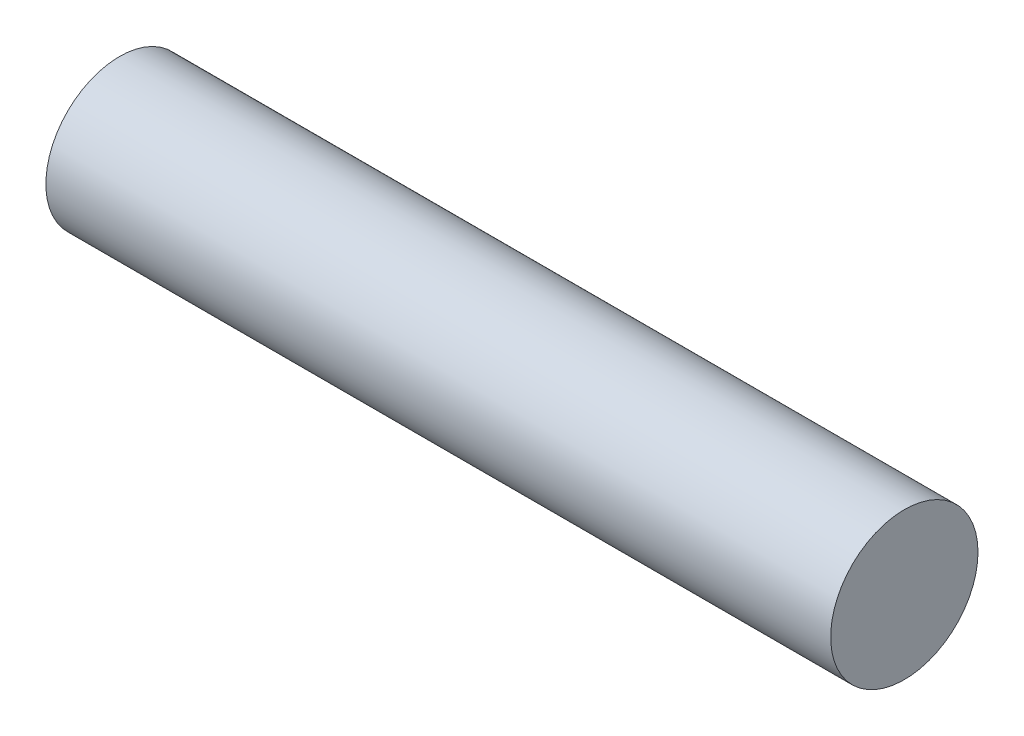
ISO-10303-21;
HEADER;
FILE_DESCRIPTION(('STEP AP214'),'2;1');
FILE_NAME('part.step','',(''),(''),'','','');
FILE_SCHEMA(('AUTOMOTIVE_DESIGN { 1 0 10303 214 1 1 1 1 }'));
ENDSEC;
DATA;
#1=APPLICATION_CONTEXT('core data for automotive mechanical design processes');
#2=APPLICATION_PROTOCOL_DEFINITION('international standard','automotive_design',2000,#1);
#3=PRODUCT_CONTEXT('',#1,'mechanical');
#4=PRODUCT('Part','Part','',(#3));
#5=PRODUCT_RELATED_PRODUCT_CATEGORY('part','',(#4));
#6=PRODUCT_DEFINITION_FORMATION('','',#4);
#7=PRODUCT_DEFINITION_CONTEXT('part definition',#1,'design');
#8=PRODUCT_DEFINITION('design','',#6,#7);
#9=PRODUCT_DEFINITION_SHAPE('','',#8);
#10=(LENGTH_UNIT() NAMED_UNIT(*) SI_UNIT(.MILLI.,.METRE.));
#11=(NAMED_UNIT(*) PLANE_ANGLE_UNIT() SI_UNIT($,.RADIAN.));
#12=(NAMED_UNIT(*) SI_UNIT($,.STERADIAN.) SOLID_ANGLE_UNIT());
#13=UNCERTAINTY_MEASURE_WITH_UNIT(LENGTH_MEASURE(1.E-05),#10,'distance_accuracy_value','');
#14=(GEOMETRIC_REPRESENTATION_CONTEXT(3) GLOBAL_UNCERTAINTY_ASSIGNED_CONTEXT((#13)) GLOBAL_UNIT_ASSIGNED_CONTEXT((#10,
#11,#12)) REPRESENTATION_CONTEXT('',''));
#15=CARTESIAN_POINT('',(0.,0.,0.));
#16=DIRECTION('',(0.,0.,1.));
#17=DIRECTION('',(1.,0.,0.));
#18=AXIS2_PLACEMENT_3D('',#15,#16,#17);
#19=CARTESIAN_POINT('',(0.,0.,0.));
#20=DIRECTION('',(1.,0.,0.));
#21=DIRECTION('',(0.,0.,-1.));
#22=AXIS2_PLACEMENT_3D('',#19,#20,#21);
#23=PLANE('',#22);
#24=CARTESIAN_POINT('',(0.,0.,0.));
#25=DIRECTION('',(1.,0.,0.));
#26=DIRECTION('',(0.,0.,-1.));
#27=AXIS2_PLACEMENT_3D('',#24,#25,#26);
#28=CIRCLE('',#27,15.);
#29=CARTESIAN_POINT('',(0.,0.,-15.));
#30=VERTEX_POINT('',#29);
#31=EDGE_CURVE('E10',#30,#30,#28,.T.);
#32=ORIENTED_EDGE('',*,*,#31,.T.);
#33=EDGE_LOOP('',(#32));
#34=FACE_BOUND('',#33,.T.);
#35=ADVANCED_FACE('F31',(#34),#23,.T.);
#36=CARTESIAN_POINT('',(0.,0.,0.));
#37=DIRECTION('',(1.,0.,0.));
#38=DIRECTION('',(0.,0.,-1.));
#39=AXIS2_PLACEMENT_3D('',#36,#37,#38);
#40=CYLINDRICAL_SURFACE('',#39,15.);
#41=CARTESIAN_POINT('',(-159.796105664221,0.,0.));
#42=DIRECTION('',(1.,0.,0.));
#43=DIRECTION('',(0.,0.,-1.));
#44=AXIS2_PLACEMENT_3D('',#41,#42,#43);
#45=CIRCLE('',#44,15.);
#46=CARTESIAN_POINT('',(-159.796105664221,0.,-15.));
#47=VERTEX_POINT('',#46);
#48=EDGE_CURVE('E37',#47,#47,#45,.T.);
#49=ORIENTED_EDGE('',*,*,#48,.T.);
#50=EDGE_LOOP('',(#49));
#51=FACE_BOUND('',#50,.T.);
#52=ORIENTED_EDGE('',*,*,#31,.F.);
#53=EDGE_LOOP('',(#52));
#54=FACE_BOUND('',#53,.T.);
#55=ADVANCED_FACE('F43',(#51,#54),#40,.T.);
#56=CARTESIAN_POINT('',(-159.796105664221,0.,0.));
#57=DIRECTION('',(-1.,0.,0.));
#58=DIRECTION('',(0.,0.,1.));
#59=AXIS2_PLACEMENT_3D('',#56,#57,#58);
#60=PLANE('',#59);
#61=ORIENTED_EDGE('',*,*,#48,.F.);
#62=EDGE_LOOP('',(#61));
#63=FACE_BOUND('',#62,.T.);
#64=ADVANCED_FACE('F46',(#63),#60,.T.);
#65=CLOSED_SHELL('',(#35,#55,#64));
#66=MANIFOLD_SOLID_BREP('B2',#65);
#67=ADVANCED_BREP_SHAPE_REPRESENTATION('',(#18,#66),#14);
#68=SHAPE_DEFINITION_REPRESENTATION(#9,#67);
ENDSEC;
END-ISO-10303-21;
